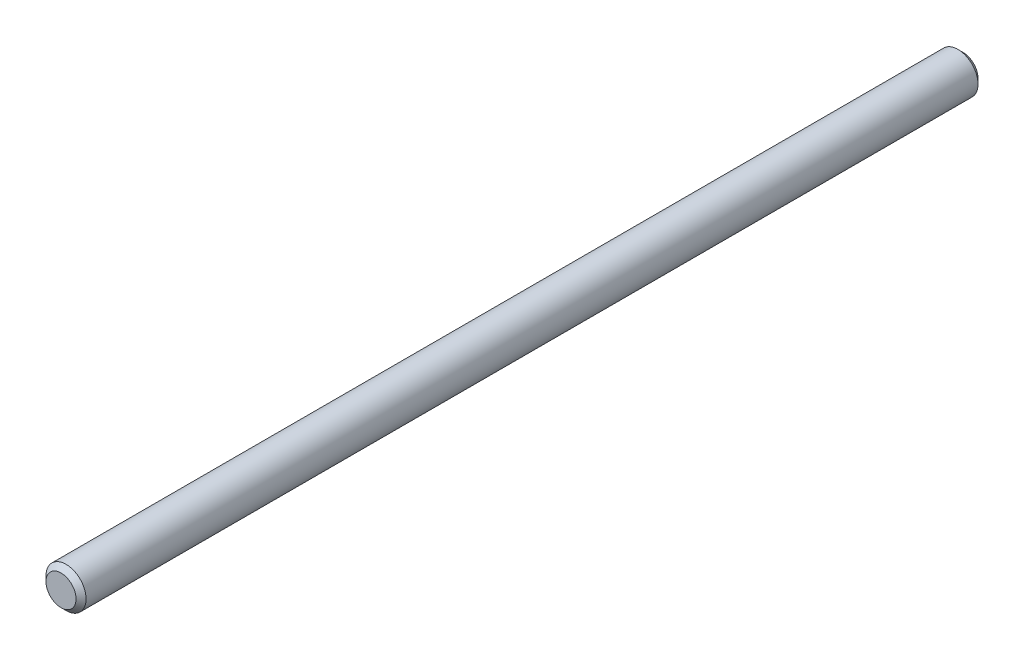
from build123d import *

# Parameters (mm, degrees)
SKETCH_1_R      = 2
EXTRUDE_1_DEPTH = 90
CHAMFER_1_SIZE  = 0.5


with BuildPart() as part:
    # Sketch 1 → Extrude 1 (new body)
    with BuildSketch(Plane.XY):
        Circle(SKETCH_1_R)
    extrude(amount=-EXTRUDE_1_DEPTH)

    # Chamfer 1
    chamfer_1_edges = [part.edges().sort_by_distance(p)[0] for p in [
        (-2, 0, 0),
        (-2, 0, -90),
    ]]
    chamfer(chamfer_1_edges, length=CHAMFER_1_SIZE)


solid = part.part
